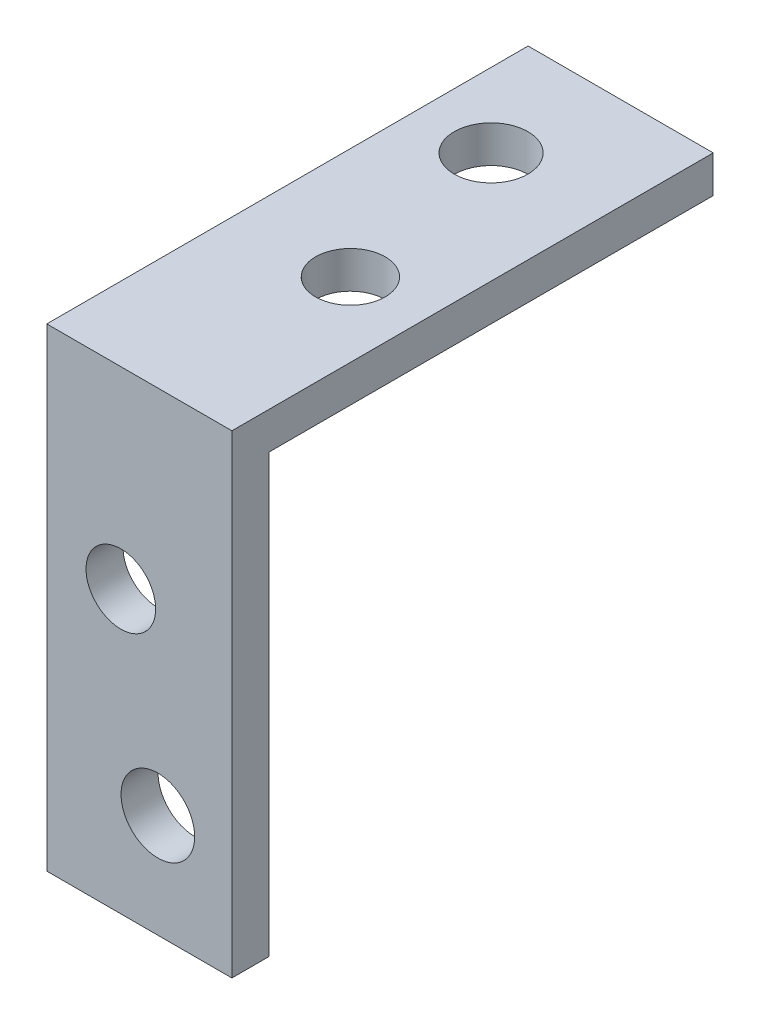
ISO-10303-21;
HEADER;
FILE_DESCRIPTION(('STEP AP214'),'2;1');
FILE_NAME('part.step','',(''),(''),'','','');
FILE_SCHEMA(('AUTOMOTIVE_DESIGN { 1 0 10303 214 1 1 1 1 }'));
ENDSEC;
DATA;
#1=APPLICATION_CONTEXT('core data for automotive mechanical design processes');
#2=APPLICATION_PROTOCOL_DEFINITION('international standard','automotive_design',2000,#1);
#3=PRODUCT_CONTEXT('',#1,'mechanical');
#4=PRODUCT('Part','Part','',(#3));
#5=PRODUCT_RELATED_PRODUCT_CATEGORY('part','',(#4));
#6=PRODUCT_DEFINITION_FORMATION('','',#4);
#7=PRODUCT_DEFINITION_CONTEXT('part definition',#1,'design');
#8=PRODUCT_DEFINITION('design','',#6,#7);
#9=PRODUCT_DEFINITION_SHAPE('','',#8);
#10=(LENGTH_UNIT() NAMED_UNIT(*) SI_UNIT(.MILLI.,.METRE.));
#11=(NAMED_UNIT(*) PLANE_ANGLE_UNIT() SI_UNIT($,.RADIAN.));
#12=(NAMED_UNIT(*) SI_UNIT($,.STERADIAN.) SOLID_ANGLE_UNIT());
#13=UNCERTAINTY_MEASURE_WITH_UNIT(LENGTH_MEASURE(1.E-05),#10,'distance_accuracy_value','');
#14=(GEOMETRIC_REPRESENTATION_CONTEXT(3) GLOBAL_UNCERTAINTY_ASSIGNED_CONTEXT((#13)) GLOBAL_UNIT_ASSIGNED_CONTEXT((#10,
#11,#12)) REPRESENTATION_CONTEXT('',''));
#15=CARTESIAN_POINT('',(0.,0.,0.));
#16=DIRECTION('',(0.,0.,1.));
#17=DIRECTION('',(1.,0.,0.));
#18=AXIS2_PLACEMENT_3D('',#15,#16,#17);
#19=CARTESIAN_POINT('',(0.,0.,0.));
#20=DIRECTION('',(0.,1.,0.));
#21=DIRECTION('',(0.,0.,1.));
#22=AXIS2_PLACEMENT_3D('',#19,#20,#21);
#23=PLANE('',#22);
#24=CARTESIAN_POINT('',(6.35000000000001,0.,-31.75));
#25=DIRECTION('',(0.,1.,0.));
#26=DIRECTION('',(0.,0.,1.));
#27=AXIS2_PLACEMENT_3D('',#24,#25,#26);
#28=CIRCLE('',#27,3.15778945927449);
#29=CARTESIAN_POINT('',(6.35000000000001,0.,-28.5922105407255));
#30=VERTEX_POINT('',#29);
#31=EDGE_CURVE('E132',#30,#30,#28,.T.);
#32=ORIENTED_EDGE('',*,*,#31,.T.);
#33=EDGE_LOOP('',(#32));
#34=FACE_BOUND('',#33,.T.);
#35=CARTESIAN_POINT('',(9.525,0.,-16.51));
#36=DIRECTION('',(0.,1.,0.));
#37=DIRECTION('',(0.,0.,1.));
#38=AXIS2_PLACEMENT_3D('',#35,#36,#37);
#39=CIRCLE('',#38,2.9845);
#40=CARTESIAN_POINT('',(9.525,0.,-13.5255));
#41=VERTEX_POINT('',#40);
#42=EDGE_CURVE('E126',#41,#41,#39,.T.);
#43=ORIENTED_EDGE('',*,*,#42,.T.);
#44=EDGE_LOOP('',(#43));
#45=FACE_BOUND('',#44,.T.);
#46=DIRECTION('',(1.,0.,0.));
#47=VECTOR('',#46,1.);
#48=CARTESIAN_POINT('',(0.,0.,-3.175));
#49=LINE('',#48,#47);
#50=CARTESIAN_POINT('',(0.,0.,-3.175));
#51=VERTEX_POINT('',#50);
#52=CARTESIAN_POINT('',(15.875,0.,-3.175));
#53=VERTEX_POINT('',#52);
#54=EDGE_CURVE('E120',#51,#53,#49,.T.);
#55=ORIENTED_EDGE('',*,*,#54,.F.);
#56=DIRECTION('',(0.,0.,1.));
#57=VECTOR('',#56,1.);
#58=CARTESIAN_POINT('',(0.,0.,-41.275));
#59=LINE('',#58,#57);
#60=CARTESIAN_POINT('',(0.,0.,-41.275));
#61=VERTEX_POINT('',#60);
#62=EDGE_CURVE('E106',#61,#51,#59,.T.);
#63=ORIENTED_EDGE('',*,*,#62,.F.);
#64=DIRECTION('',(-1.,0.,0.));
#65=VECTOR('',#64,1.);
#66=CARTESIAN_POINT('',(0.,0.,-41.275));
#67=LINE('',#66,#65);
#68=CARTESIAN_POINT('',(15.875,0.,-41.275));
#69=VERTEX_POINT('',#68);
#70=EDGE_CURVE('E111',#69,#61,#67,.T.);
#71=ORIENTED_EDGE('',*,*,#70,.F.);
#72=DIRECTION('',(0.,0.,-1.));
#73=VECTOR('',#72,1.);
#74=CARTESIAN_POINT('',(15.875,0.,-41.275));
#75=LINE('',#74,#73);
#76=EDGE_CURVE('E60',#53,#69,#75,.T.);
#77=ORIENTED_EDGE('',*,*,#76,.F.);
#78=EDGE_LOOP('',(#55,#63,#71,#77));
#79=FACE_BOUND('',#78,.T.);
#80=ADVANCED_FACE('F31',(#34,#45,#79),#23,.F.);
#81=CARTESIAN_POINT('',(0.,3.175,0.));
#82=DIRECTION('',(0.,1.,0.));
#83=DIRECTION('',(0.,0.,1.));
#84=AXIS2_PLACEMENT_3D('',#81,#82,#83);
#85=PLANE('',#84);
#86=DIRECTION('',(0.,0.,-1.));
#87=VECTOR('',#86,1.);
#88=CARTESIAN_POINT('',(15.875,3.175,-41.275));
#89=LINE('',#88,#87);
#90=CARTESIAN_POINT('',(15.875,3.175,0.));
#91=VERTEX_POINT('',#90);
#92=CARTESIAN_POINT('',(15.875,3.175,-41.275));
#93=VERTEX_POINT('',#92);
#94=EDGE_CURVE('E84',#91,#93,#89,.T.);
#95=ORIENTED_EDGE('',*,*,#94,.T.);
#96=DIRECTION('',(-1.,0.,0.));
#97=VECTOR('',#96,1.);
#98=CARTESIAN_POINT('',(0.,3.175,-41.275));
#99=LINE('',#98,#97);
#100=CARTESIAN_POINT('',(0.,3.175,-41.275));
#101=VERTEX_POINT('',#100);
#102=EDGE_CURVE('E48',#93,#101,#99,.T.);
#103=ORIENTED_EDGE('',*,*,#102,.T.);
#104=DIRECTION('',(0.,0.,1.));
#105=VECTOR('',#104,1.);
#106=CARTESIAN_POINT('',(0.,3.175,-41.275));
#107=LINE('',#106,#105);
#108=CARTESIAN_POINT('',(0.,3.175,0.));
#109=VERTEX_POINT('',#108);
#110=EDGE_CURVE('E86',#101,#109,#107,.T.);
#111=ORIENTED_EDGE('',*,*,#110,.T.);
#112=DIRECTION('',(1.,0.,0.));
#113=VECTOR('',#112,1.);
#114=CARTESIAN_POINT('',(0.,3.175,0.));
#115=LINE('',#114,#113);
#116=EDGE_CURVE('E79',#109,#91,#115,.T.);
#117=ORIENTED_EDGE('',*,*,#116,.T.);
#118=EDGE_LOOP('',(#95,#103,#111,#117));
#119=FACE_BOUND('',#118,.T.);
#120=CARTESIAN_POINT('',(6.35000000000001,3.175,-31.75));
#121=DIRECTION('',(0.,1.,0.));
#122=DIRECTION('',(0.,0.,1.));
#123=AXIS2_PLACEMENT_3D('',#120,#121,#122);
#124=CIRCLE('',#123,3.15778945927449);
#125=CARTESIAN_POINT('',(6.35000000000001,3.175,-28.5922105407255));
#126=VERTEX_POINT('',#125);
#127=EDGE_CURVE('E129',#126,#126,#124,.T.);
#128=ORIENTED_EDGE('',*,*,#127,.F.);
#129=EDGE_LOOP('',(#128));
#130=FACE_BOUND('',#129,.T.);
#131=CARTESIAN_POINT('',(9.525,3.175,-16.51));
#132=DIRECTION('',(0.,1.,0.));
#133=DIRECTION('',(0.,0.,1.));
#134=AXIS2_PLACEMENT_3D('',#131,#132,#133);
#135=CIRCLE('',#134,2.9845);
#136=CARTESIAN_POINT('',(9.525,3.175,-13.5255));
#137=VERTEX_POINT('',#136);
#138=EDGE_CURVE('E109',#137,#137,#135,.T.);
#139=ORIENTED_EDGE('',*,*,#138,.F.);
#140=EDGE_LOOP('',(#139));
#141=FACE_BOUND('',#140,.T.);
#142=ADVANCED_FACE('F81',(#119,#130,#141),#85,.T.);
#143=CARTESIAN_POINT('',(0.,3.175,-41.275));
#144=DIRECTION('',(1.,0.,0.));
#145=DIRECTION('',(0.,0.,-1.));
#146=AXIS2_PLACEMENT_3D('',#143,#144,#145);
#147=PLANE('',#146);
#148=DIRECTION('',(0.,-1.,0.));
#149=VECTOR('',#148,1.);
#150=CARTESIAN_POINT('',(0.,3.175,0.));
#151=LINE('',#150,#149);
#152=CARTESIAN_POINT('',(0.,-37.465,0.));
#153=VERTEX_POINT('',#152);
#154=EDGE_CURVE('E11',#109,#153,#151,.T.);
#155=ORIENTED_EDGE('',*,*,#154,.F.);
#156=ORIENTED_EDGE('',*,*,#110,.F.);
#157=DIRECTION('',(0.,-1.,0.));
#158=VECTOR('',#157,1.);
#159=CARTESIAN_POINT('',(0.,3.175,-41.275));
#160=LINE('',#159,#158);
#161=EDGE_CURVE('E102',#101,#61,#160,.T.);
#162=ORIENTED_EDGE('',*,*,#161,.T.);
#163=ORIENTED_EDGE('',*,*,#62,.T.);
#164=DIRECTION('',(0.,-1.,0.));
#165=VECTOR('',#164,1.);
#166=CARTESIAN_POINT('',(0.,-37.465,-3.175));
#167=LINE('',#166,#165);
#168=CARTESIAN_POINT('',(0.,-37.465,-3.175));
#169=VERTEX_POINT('',#168);
#170=EDGE_CURVE('E71',#51,#169,#167,.T.);
#171=ORIENTED_EDGE('',*,*,#170,.T.);
#172=DIRECTION('',(0.,0.,1.));
#173=VECTOR('',#172,1.);
#174=CARTESIAN_POINT('',(0.,-37.465,-3.175));
#175=LINE('',#174,#173);
#176=EDGE_CURVE('E139',#169,#153,#175,.T.);
#177=ORIENTED_EDGE('',*,*,#176,.T.);
#178=EDGE_LOOP('',(#155,#156,#162,#163,#171,#177));
#179=FACE_BOUND('',#178,.T.);
#180=ADVANCED_FACE('F33',(#179),#147,.F.);
#181=CARTESIAN_POINT('',(0.,3.175,0.));
#182=DIRECTION('',(0.,0.,-1.));
#183=DIRECTION('',(-1.,0.,0.));
#184=AXIS2_PLACEMENT_3D('',#181,#182,#183);
#185=PLANE('',#184);
#186=ORIENTED_EDGE('',*,*,#154,.T.);
#187=DIRECTION('',(1.,0.,0.));
#188=VECTOR('',#187,1.);
#189=CARTESIAN_POINT('',(15.875,-37.465,0.));
#190=LINE('',#189,#188);
#191=CARTESIAN_POINT('',(15.875,-37.465,0.));
#192=VERTEX_POINT('',#191);
#193=EDGE_CURVE('E96',#153,#192,#190,.T.);
#194=ORIENTED_EDGE('',*,*,#193,.T.);
#195=DIRECTION('',(0.,-1.,0.));
#196=VECTOR('',#195,1.);
#197=CARTESIAN_POINT('',(15.875,3.175,0.));
#198=LINE('',#197,#196);
#199=EDGE_CURVE('E40',#91,#192,#198,.T.);
#200=ORIENTED_EDGE('',*,*,#199,.F.);
#201=ORIENTED_EDGE('',*,*,#116,.F.);
#202=EDGE_LOOP('',(#186,#194,#200,#201));
#203=FACE_BOUND('',#202,.T.);
#204=CARTESIAN_POINT('',(6.35,-13.335,0.));
#205=DIRECTION('',(0.,0.,1.));
#206=DIRECTION('',(1.,0.,0.));
#207=AXIS2_PLACEMENT_3D('',#204,#205,#206);
#208=CIRCLE('',#207,2.98450000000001);
#209=CARTESIAN_POINT('',(9.33450000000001,-13.335,0.));
#210=VERTEX_POINT('',#209);
#211=EDGE_CURVE('E150',#210,#210,#208,.T.);
#212=ORIENTED_EDGE('',*,*,#211,.F.);
#213=EDGE_LOOP('',(#212));
#214=FACE_BOUND('',#213,.T.);
#215=CARTESIAN_POINT('',(9.525,-28.575,0.));
#216=DIRECTION('',(0.,0.,1.));
#217=DIRECTION('',(1.,0.,0.));
#218=AXIS2_PLACEMENT_3D('',#215,#216,#217);
#219=CIRCLE('',#218,3.15778945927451);
#220=CARTESIAN_POINT('',(12.6827894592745,-28.575,0.));
#221=VERTEX_POINT('',#220);
#222=EDGE_CURVE('E156',#221,#221,#219,.T.);
#223=ORIENTED_EDGE('',*,*,#222,.F.);
#224=EDGE_LOOP('',(#223));
#225=FACE_BOUND('',#224,.T.);
#226=ADVANCED_FACE('F92',(#203,#214,#225),#185,.F.);
#227=CARTESIAN_POINT('',(15.875,3.175,-41.275));
#228=DIRECTION('',(-1.,0.,0.));
#229=DIRECTION('',(0.,0.,1.));
#230=AXIS2_PLACEMENT_3D('',#227,#228,#229);
#231=PLANE('',#230);
#232=ORIENTED_EDGE('',*,*,#199,.T.);
#233=DIRECTION('',(0.,0.,1.));
#234=VECTOR('',#233,1.);
#235=CARTESIAN_POINT('',(15.875,-37.465,-3.175));
#236=LINE('',#235,#234);
#237=CARTESIAN_POINT('',(15.875,-37.465,-3.175));
#238=VERTEX_POINT('',#237);
#239=EDGE_CURVE('E138',#238,#192,#236,.T.);
#240=ORIENTED_EDGE('',*,*,#239,.F.);
#241=DIRECTION('',(0.,1.,0.));
#242=VECTOR('',#241,1.);
#243=CARTESIAN_POINT('',(15.875,-37.465,-3.175));
#244=LINE('',#243,#242);
#245=EDGE_CURVE('E144',#238,#53,#244,.T.);
#246=ORIENTED_EDGE('',*,*,#245,.T.);
#247=ORIENTED_EDGE('',*,*,#76,.T.);
#248=DIRECTION('',(0.,-1.,0.));
#249=VECTOR('',#248,1.);
#250=CARTESIAN_POINT('',(15.875,3.175,-41.275));
#251=LINE('',#250,#249);
#252=EDGE_CURVE('E99',#93,#69,#251,.T.);
#253=ORIENTED_EDGE('',*,*,#252,.F.);
#254=ORIENTED_EDGE('',*,*,#94,.F.);
#255=EDGE_LOOP('',(#232,#240,#246,#247,#253,#254));
#256=FACE_BOUND('',#255,.T.);
#257=ADVANCED_FACE('F100',(#256),#231,.F.);
#258=CARTESIAN_POINT('',(0.,3.175,-41.275));
#259=DIRECTION('',(0.,0.,1.));
#260=DIRECTION('',(1.,0.,0.));
#261=AXIS2_PLACEMENT_3D('',#258,#259,#260);
#262=PLANE('',#261);
#263=ORIENTED_EDGE('',*,*,#70,.T.);
#264=ORIENTED_EDGE('',*,*,#161,.F.);
#265=ORIENTED_EDGE('',*,*,#102,.F.);
#266=ORIENTED_EDGE('',*,*,#252,.T.);
#267=EDGE_LOOP('',(#263,#264,#265,#266));
#268=FACE_BOUND('',#267,.T.);
#269=ADVANCED_FACE('F117',(#268),#262,.F.);
#270=CARTESIAN_POINT('',(9.525,3.175,-16.51));
#271=DIRECTION('',(0.,-1.,0.));
#272=DIRECTION('',(0.,0.,-1.));
#273=AXIS2_PLACEMENT_3D('',#270,#271,#272);
#274=CYLINDRICAL_SURFACE('',#273,2.9845);
#275=ORIENTED_EDGE('',*,*,#138,.T.);
#276=EDGE_LOOP('',(#275));
#277=FACE_BOUND('',#276,.T.);
#278=ORIENTED_EDGE('',*,*,#42,.F.);
#279=EDGE_LOOP('',(#278));
#280=FACE_BOUND('',#279,.T.);
#281=ADVANCED_FACE('F188',(#277,#280),#274,.F.);
#282=CARTESIAN_POINT('',(6.35000000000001,3.175,-31.75));
#283=DIRECTION('',(0.,-1.,0.));
#284=DIRECTION('',(0.,0.,-1.));
#285=AXIS2_PLACEMENT_3D('',#282,#283,#284);
#286=CYLINDRICAL_SURFACE('',#285,3.15778945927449);
#287=ORIENTED_EDGE('',*,*,#127,.T.);
#288=EDGE_LOOP('',(#287));
#289=FACE_BOUND('',#288,.T.);
#290=ORIENTED_EDGE('',*,*,#31,.F.);
#291=EDGE_LOOP('',(#290));
#292=FACE_BOUND('',#291,.T.);
#293=ADVANCED_FACE('F192',(#289,#292),#286,.F.);
#294=CARTESIAN_POINT('',(15.875,3.175,-3.175));
#295=DIRECTION('',(0.,0.,1.));
#296=DIRECTION('',(1.,0.,0.));
#297=AXIS2_PLACEMENT_3D('',#294,#295,#296);
#298=PLANE('',#297);
#299=CARTESIAN_POINT('',(6.35,-13.335,-3.175));
#300=DIRECTION('',(0.,0.,1.));
#301=DIRECTION('',(1.,0.,0.));
#302=AXIS2_PLACEMENT_3D('',#299,#300,#301);
#303=CIRCLE('',#302,2.98450000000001);
#304=CARTESIAN_POINT('',(9.33450000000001,-13.335,-3.175));
#305=VERTEX_POINT('',#304);
#306=EDGE_CURVE('E145',#305,#305,#303,.T.);
#307=ORIENTED_EDGE('',*,*,#306,.T.);
#308=EDGE_LOOP('',(#307));
#309=FACE_BOUND('',#308,.T.);
#310=CARTESIAN_POINT('',(9.525,-28.575,-3.175));
#311=DIRECTION('',(0.,0.,1.));
#312=DIRECTION('',(1.,0.,0.));
#313=AXIS2_PLACEMENT_3D('',#310,#311,#312);
#314=CIRCLE('',#313,3.15778945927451);
#315=CARTESIAN_POINT('',(12.6827894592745,-28.575,-3.175));
#316=VERTEX_POINT('',#315);
#317=EDGE_CURVE('E153',#316,#316,#314,.T.);
#318=ORIENTED_EDGE('',*,*,#317,.T.);
#319=EDGE_LOOP('',(#318));
#320=FACE_BOUND('',#319,.T.);
#321=ORIENTED_EDGE('',*,*,#170,.F.);
#322=ORIENTED_EDGE('',*,*,#54,.T.);
#323=ORIENTED_EDGE('',*,*,#245,.F.);
#324=DIRECTION('',(1.,0.,0.));
#325=VECTOR('',#324,1.);
#326=CARTESIAN_POINT('',(15.875,-37.465,-3.175));
#327=LINE('',#326,#325);
#328=EDGE_CURVE('E141',#169,#238,#327,.T.);
#329=ORIENTED_EDGE('',*,*,#328,.F.);
#330=EDGE_LOOP('',(#321,#322,#323,#329));
#331=FACE_BOUND('',#330,.T.);
#332=ADVANCED_FACE('F162',(#309,#320,#331),#298,.F.);
#333=CARTESIAN_POINT('',(15.875,-37.465,-3.175));
#334=DIRECTION('',(0.,-1.,0.));
#335=DIRECTION('',(1.,0.,0.));
#336=AXIS2_PLACEMENT_3D('',#333,#334,#335);
#337=PLANE('',#336);
#338=ORIENTED_EDGE('',*,*,#193,.F.);
#339=ORIENTED_EDGE('',*,*,#176,.F.);
#340=ORIENTED_EDGE('',*,*,#328,.T.);
#341=ORIENTED_EDGE('',*,*,#239,.T.);
#342=EDGE_LOOP('',(#338,#339,#340,#341));
#343=FACE_BOUND('',#342,.T.);
#344=ADVANCED_FACE('F201',(#343),#337,.T.);
#345=CARTESIAN_POINT('',(6.35,-13.335,-3.175));
#346=DIRECTION('',(0.,0.,1.));
#347=DIRECTION('',(1.,0.,0.));
#348=AXIS2_PLACEMENT_3D('',#345,#346,#347);
#349=CYLINDRICAL_SURFACE('',#348,2.98450000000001);
#350=ORIENTED_EDGE('',*,*,#306,.F.);
#351=EDGE_LOOP('',(#350));
#352=FACE_BOUND('',#351,.T.);
#353=ORIENTED_EDGE('',*,*,#211,.T.);
#354=EDGE_LOOP('',(#353));
#355=FACE_BOUND('',#354,.T.);
#356=ADVANCED_FACE('F167',(#352,#355),#349,.F.);
#357=CARTESIAN_POINT('',(9.525,-28.575,-3.175));
#358=DIRECTION('',(0.,0.,1.));
#359=DIRECTION('',(1.,0.,0.));
#360=AXIS2_PLACEMENT_3D('',#357,#358,#359);
#361=CYLINDRICAL_SURFACE('',#360,3.15778945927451);
#362=ORIENTED_EDGE('',*,*,#317,.F.);
#363=EDGE_LOOP('',(#362));
#364=FACE_BOUND('',#363,.T.);
#365=ORIENTED_EDGE('',*,*,#222,.T.);
#366=EDGE_LOOP('',(#365));
#367=FACE_BOUND('',#366,.T.);
#368=ADVANCED_FACE('F164',(#364,#367),#361,.F.);
#369=CLOSED_SHELL('',(#80,#142,#180,#226,#257,#269,#281,#293,#332,#344,#356,#368));
#370=MANIFOLD_SOLID_BREP('B2',#369);
#371=ADVANCED_BREP_SHAPE_REPRESENTATION('',(#18,#370),#14);
#372=SHAPE_DEFINITION_REPRESENTATION(#9,#371);
ENDSEC;
END-ISO-10303-21;
